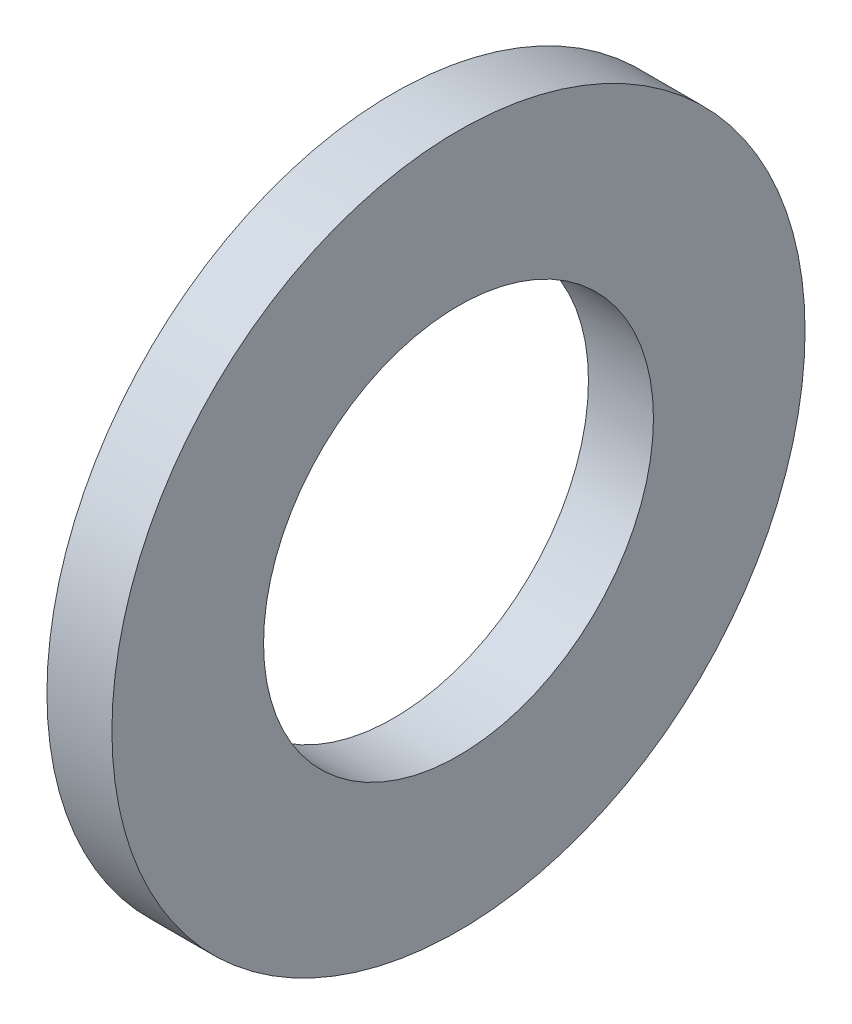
ISO-10303-21;
HEADER;
FILE_DESCRIPTION(('STEP AP214'),'2;1');
FILE_NAME('part.step','',(''),(''),'','','');
FILE_SCHEMA(('AUTOMOTIVE_DESIGN { 1 0 10303 214 1 1 1 1 }'));
ENDSEC;
DATA;
#1=APPLICATION_CONTEXT('core data for automotive mechanical design processes');
#2=APPLICATION_PROTOCOL_DEFINITION('international standard','automotive_design',2000,#1);
#3=PRODUCT_CONTEXT('',#1,'mechanical');
#4=PRODUCT('Part','Part','',(#3));
#5=PRODUCT_RELATED_PRODUCT_CATEGORY('part','',(#4));
#6=PRODUCT_DEFINITION_FORMATION('','',#4);
#7=PRODUCT_DEFINITION_CONTEXT('part definition',#1,'design');
#8=PRODUCT_DEFINITION('design','',#6,#7);
#9=PRODUCT_DEFINITION_SHAPE('','',#8);
#10=(LENGTH_UNIT() NAMED_UNIT(*) SI_UNIT(.MILLI.,.METRE.));
#11=(NAMED_UNIT(*) PLANE_ANGLE_UNIT() SI_UNIT($,.RADIAN.));
#12=(NAMED_UNIT(*) SI_UNIT($,.STERADIAN.) SOLID_ANGLE_UNIT());
#13=UNCERTAINTY_MEASURE_WITH_UNIT(LENGTH_MEASURE(1.E-05),#10,'distance_accuracy_value','');
#14=(GEOMETRIC_REPRESENTATION_CONTEXT(3) GLOBAL_UNCERTAINTY_ASSIGNED_CONTEXT((#13)) GLOBAL_UNIT_ASSIGNED_CONTEXT((#10,
#11,#12)) REPRESENTATION_CONTEXT('',''));
#15=CARTESIAN_POINT('',(0.,0.,0.));
#16=DIRECTION('',(0.,0.,1.));
#17=DIRECTION('',(1.,0.,0.));
#18=AXIS2_PLACEMENT_3D('',#15,#16,#17);
#19=CARTESIAN_POINT('',(1.5,0.,0.));
#20=DIRECTION('',(1.,0.,0.));
#21=DIRECTION('',(0.,0.,-1.));
#22=AXIS2_PLACEMENT_3D('',#19,#20,#21);
#23=CIRCLE('',#22,9.);
#24=DIRECTION('',(-1.,0.,0.));
#25=VECTOR('',#24,1.);
#26=SURFACE_OF_LINEAR_EXTRUSION('',#23,#25);
#27=CARTESIAN_POINT('',(3.,0.,0.));
#28=DIRECTION('',(-1.,0.,0.));
#29=DIRECTION('',(0.,0.,-1.));
#30=AXIS2_PLACEMENT_3D('',#27,#28,#29);
#31=CIRCLE('',#30,9.);
#32=CARTESIAN_POINT('',(3.,0.,-9.));
#33=VERTEX_POINT('',#32);
#34=EDGE_CURVE('E28',#33,#33,#31,.T.);
#35=ORIENTED_EDGE('',*,*,#34,.F.);
#36=EDGE_LOOP('',(#35));
#37=FACE_BOUND('',#36,.T.);
#38=CARTESIAN_POINT('',(0.,0.,0.));
#39=DIRECTION('',(-1.,0.,0.));
#40=DIRECTION('',(0.,0.,-1.));
#41=AXIS2_PLACEMENT_3D('',#38,#39,#40);
#42=CIRCLE('',#41,9.);
#43=CARTESIAN_POINT('',(0.,0.,-9.));
#44=VERTEX_POINT('',#43);
#45=EDGE_CURVE('E32',#44,#44,#42,.T.);
#46=ORIENTED_EDGE('',*,*,#45,.T.);
#47=EDGE_LOOP('',(#46));
#48=FACE_BOUND('',#47,.T.);
#49=ADVANCED_FACE('F15',(#37,#48),#26,.T.);
#50=CARTESIAN_POINT('',(0.,0.,-12.5));
#51=DIRECTION('',(-1.,0.,0.));
#52=DIRECTION('',(0.,0.,1.));
#53=AXIS2_PLACEMENT_3D('',#50,#51,#52);
#54=PLANE('',#53);
#55=CARTESIAN_POINT('',(0.,0.,0.));
#56=DIRECTION('',(-1.,0.,0.));
#57=DIRECTION('',(0.,0.,-1.));
#58=AXIS2_PLACEMENT_3D('',#55,#56,#57);
#59=CIRCLE('',#58,16.);
#60=CARTESIAN_POINT('',(0.,0.,-16.));
#61=VERTEX_POINT('',#60);
#62=EDGE_CURVE('E10',#61,#61,#59,.T.);
#63=ORIENTED_EDGE('',*,*,#62,.T.);
#64=EDGE_LOOP('',(#63));
#65=FACE_BOUND('',#64,.T.);
#66=ORIENTED_EDGE('',*,*,#45,.F.);
#67=EDGE_LOOP('',(#66));
#68=FACE_BOUND('',#67,.T.);
#69=ADVANCED_FACE('F37',(#65,#68),#54,.T.);
#70=CARTESIAN_POINT('',(1.5,0.,0.));
#71=DIRECTION('',(-1.,0.,0.));
#72=DIRECTION('',(0.,0.,1.));
#73=AXIS2_PLACEMENT_3D('',#70,#71,#72);
#74=CYLINDRICAL_SURFACE('',#73,16.);
#75=CARTESIAN_POINT('',(3.,0.,0.));
#76=DIRECTION('',(-1.,0.,0.));
#77=DIRECTION('',(0.,0.,-1.));
#78=AXIS2_PLACEMENT_3D('',#75,#76,#77);
#79=CIRCLE('',#78,16.);
#80=CARTESIAN_POINT('',(3.,0.,-16.));
#81=VERTEX_POINT('',#80);
#82=EDGE_CURVE('E23',#81,#81,#79,.T.);
#83=ORIENTED_EDGE('',*,*,#82,.T.);
#84=EDGE_LOOP('',(#83));
#85=FACE_BOUND('',#84,.T.);
#86=ORIENTED_EDGE('',*,*,#62,.F.);
#87=EDGE_LOOP('',(#86));
#88=FACE_BOUND('',#87,.T.);
#89=ADVANCED_FACE('F39',(#85,#88),#74,.T.);
#90=CARTESIAN_POINT('',(3.,0.,-12.5));
#91=DIRECTION('',(1.,0.,0.));
#92=DIRECTION('',(0.,0.,-1.));
#93=AXIS2_PLACEMENT_3D('',#90,#91,#92);
#94=PLANE('',#93);
#95=ORIENTED_EDGE('',*,*,#34,.T.);
#96=EDGE_LOOP('',(#95));
#97=FACE_BOUND('',#96,.T.);
#98=ORIENTED_EDGE('',*,*,#82,.F.);
#99=EDGE_LOOP('',(#98));
#100=FACE_BOUND('',#99,.T.);
#101=ADVANCED_FACE('F17',(#97,#100),#94,.T.);
#102=CLOSED_SHELL('',(#49,#69,#89,#101));
#103=MANIFOLD_SOLID_BREP('B1',#102);
#104=ADVANCED_BREP_SHAPE_REPRESENTATION('',(#18,#103),#14);
#105=SHAPE_DEFINITION_REPRESENTATION(#9,#104);
ENDSEC;
END-ISO-10303-21;
